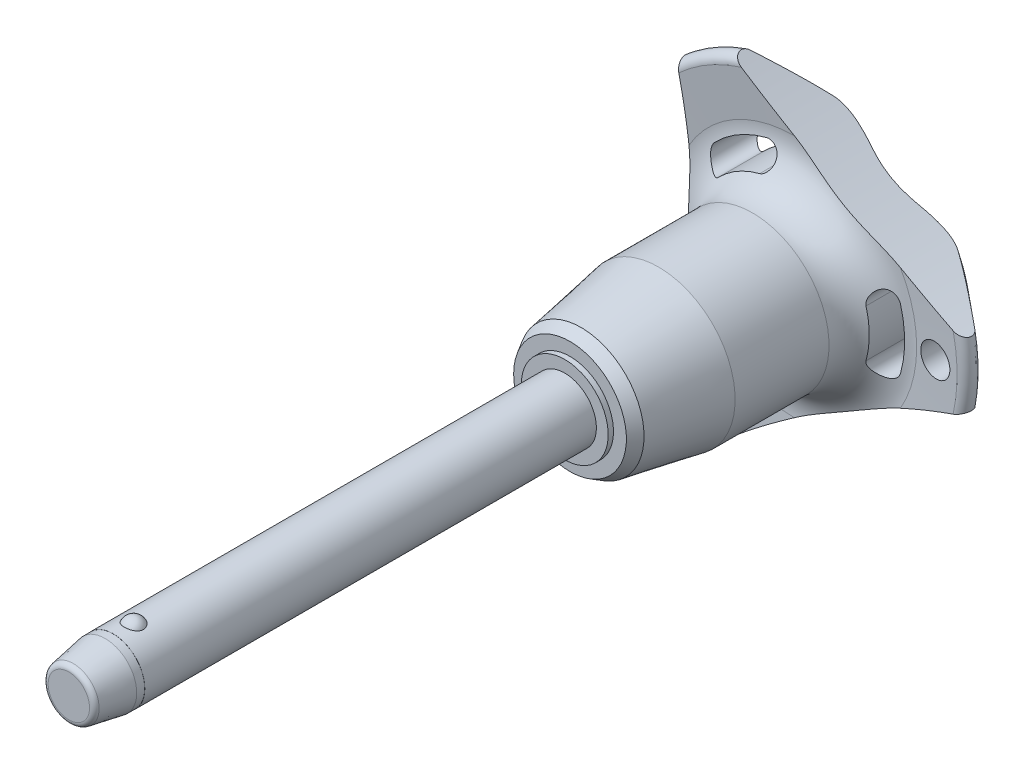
from build123d import *

# Parameters (mm, degrees)
SKETCH1_R           = 3
BOSS_EXTRUDE1_DEPTH = 40
SKETCH2_R           = 2.5
BOSS_EXTRUDE2_DEPTH = 26.7
BOSS_EXTRUDE3_START = 7
SKETCH1_2_R         = 3
BOSS_EXTRUDE3_DEPTH = 7
CHAMFER1_SIZE       = 3.5
CHAMFER1_SIZE2      = 0.617144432
FILLET1_R           = 0.5
SKETCH6_R           = 79.96
CUT_EXTRUDE1_DEPTH  = 71.711449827
CIRPATTERN1_COUNT   = 3
SKETCH7_R           = 1.5
CUT_EXTRUDE2_DEPTH  = 71.495866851
SKETCH8_R           = 3
SKETCH8_R_2         = 2.99
CUT_EXTRUDE3_DEPTH  = 4.2


with BuildPart() as part:
    # Sketch1 → Boss-Extrude1 (new body)
    with BuildSketch(Plane.XY):
        Circle(SKETCH1_R)
    extrude(amount=-BOSS_EXTRUDE1_DEPTH)

    # Sketch2 → Boss-Extrude2 (add)
    with BuildSketch(Plane(origin=(0, 0, -40), x_dir=(-1, 0, 0), z_dir=(0, 0, -1))):
        Circle(SKETCH2_R)
    extrude(amount=BOSS_EXTRUDE2_DEPTH)

    # Sketch3 → Revolve1 (revolve)
    with BuildSketch(Plane(origin=(0, 0, 0), x_dir=(0, 0, -1), z_dir=(1, 0, 0))):
        with BuildLine():
            Line((-0.866025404, 3.5), (-0.866025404, 1.5))
            ThreePointArc((-0.866025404, 1.5), (0.133974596, 2.5), (-0.866025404, 3.5))
        make_face()
        with BuildLine():
            Line((-0.866025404, -1.5), (-0.866025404, -3.5))
            ThreePointArc((-0.866025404, -3.5), (0.133974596, -2.5), (-0.866025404, -1.5))
        make_face()
    revolve(axis=Axis((0, -1.5, 0.866025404), (0, 1, 0)))

    # Sketch1_2 → Boss-Extrude3 (add)
    with BuildSketch(Plane.XY.offset(BOSS_EXTRUDE3_START)):
        Circle(SKETCH1_2_R)
    extrude(amount=-BOSS_EXTRUDE3_DEPTH)

    # Chamfer1
    chamfer1_edges = [part.edges().sort_by_distance(p)[0] for p in [
        (-3, 0, 7),
    ]]
    chamfer1_side = [part.faces().sort_by_distance(p)[0] for p in [
        (-3, 0, -16.5),
    ]]
    chamfer(chamfer1_edges, length=CHAMFER1_SIZE, length2=CHAMFER1_SIZE2, reference=chamfer1_side[0])

    # Fillet1
    fillet1_edges = [part.edges().sort_by_distance(p)[0] for p in [
        (-2.382855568, 0, 7),
        (2.5, 0, -66.7),
    ]]
    fillet(fillet1_edges, radius=FILLET1_R)

    # Sketch4 → Revolve2 (revolve)
    with BuildSketch(Plane(origin=(0, 0, 0), x_dir=(0, 0, -1), z_dir=(1, 0, 0)), mode=Mode.PRIVATE) as revolve2_sk:
        Polygon((40, 0), (40, 4.118359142), (40.5, 4.118359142), (40.5, 5.343400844), (41.560917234, 5.955921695), (48.9, 7.25), (57.8, 7.25), (57.8, 0), align=None)
    revolve(revolve2_sk.sketch.rotate(Axis((0, 0, -57.8), (0, 0, 1)), 90), axis=Axis((0, 0, -57.8), (0, 0, 1)))

    # Sketch5 → Revolve3 (revolve)
    with BuildSketch(Plane(origin=(0, 0, 0), x_dir=(0, 0, -1), z_dir=(1, 0, 0)), mode=Mode.PRIVATE) as revolve3_sk:
        with BuildLine():
            Line((61.78715932, 11.570250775), (61.452568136, 15.735949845))
            ThreePointArc((61.452568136, 15.735949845), (61.946485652, 16.540188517), (62.862835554, 16.314230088))
            Line((62.862835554, 16.314230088), (66.326414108, 12.186497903))
            ThreePointArc((66.326414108, 12.186497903), (66.7, 11.109282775), (66.261488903, 10.056825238))
            ThreePointArc((66.261488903, 10.056825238), (63.289873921, 5.413681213), (62.25, 0))
            Line((62.25, 0), (57.8, 0))
            Line((57.8, 0), (57.8, 7.25))
            ThreePointArc((57.8, 7.25), (60.739473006, 8.537160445), (61.78715932, 11.570250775))
        make_face()
    revolve(revolve3_sk.sketch.rotate(Axis((0, 0, -62.25), (0, 0, 1)), 90), axis=Axis((0, 0, -62.25), (0, 0, 1)))

    # Sketch6 → Cut-Extrude1 (cut, through all)
    with BuildSketch(Plane.XY):
        with Locations((-89.76, 0)):
            Circle(SKETCH6_R)
        with BuildLine():
            ThreePointArc((10.099921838, -2.834717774), (10.490188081, 0), (10.099921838, 2.834717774))
            ThreePointArc((10.099921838, 2.834717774), (8.768180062, 3.582738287), (8.020159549, 2.250996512))
            ThreePointArc((8.020159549, 2.250996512), (8.330062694, 0), (8.020159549, -2.250996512))
            ThreePointArc((8.020159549, -2.250996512), (8.768180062, -3.582738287), (10.099921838, -2.834717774))
        make_face()
    cut_extrude1 = extrude(amount=-CUT_EXTRUDE1_DEPTH, mode=Mode.SUBTRACT)

    # CirPattern1: Cut-Extrude1 ×3 about axis
    cirpattern1_axis = Axis((0, 0, 0), (0, 0, 1))
    for i in range(1, CIRPATTERN1_COUNT):
        add(cut_extrude1.rotate(cirpattern1_axis, i * 360 / CIRPATTERN1_COUNT), mode=Mode.SUBTRACT)

    # Sketch7 → Cut-Extrude2 (cut, through all)
    with BuildSketch(Plane.XY):
        with Locations(Location((13.490188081, 0, 0), (0, 0, 225.221865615))):
            Circle(SKETCH7_R)
    extrude(amount=-CUT_EXTRUDE2_DEPTH, mode=Mode.SUBTRACT)

    # Sketch8 → Cut-Extrude3 (cut)
    with BuildSketch(Plane.XY.offset(7)):
        Circle(SKETCH8_R)
        Circle(SKETCH8_R_2, mode=Mode.SUBTRACT)
    extrude(amount=-CUT_EXTRUDE3_DEPTH, mode=Mode.SUBTRACT)


solid = part.part
